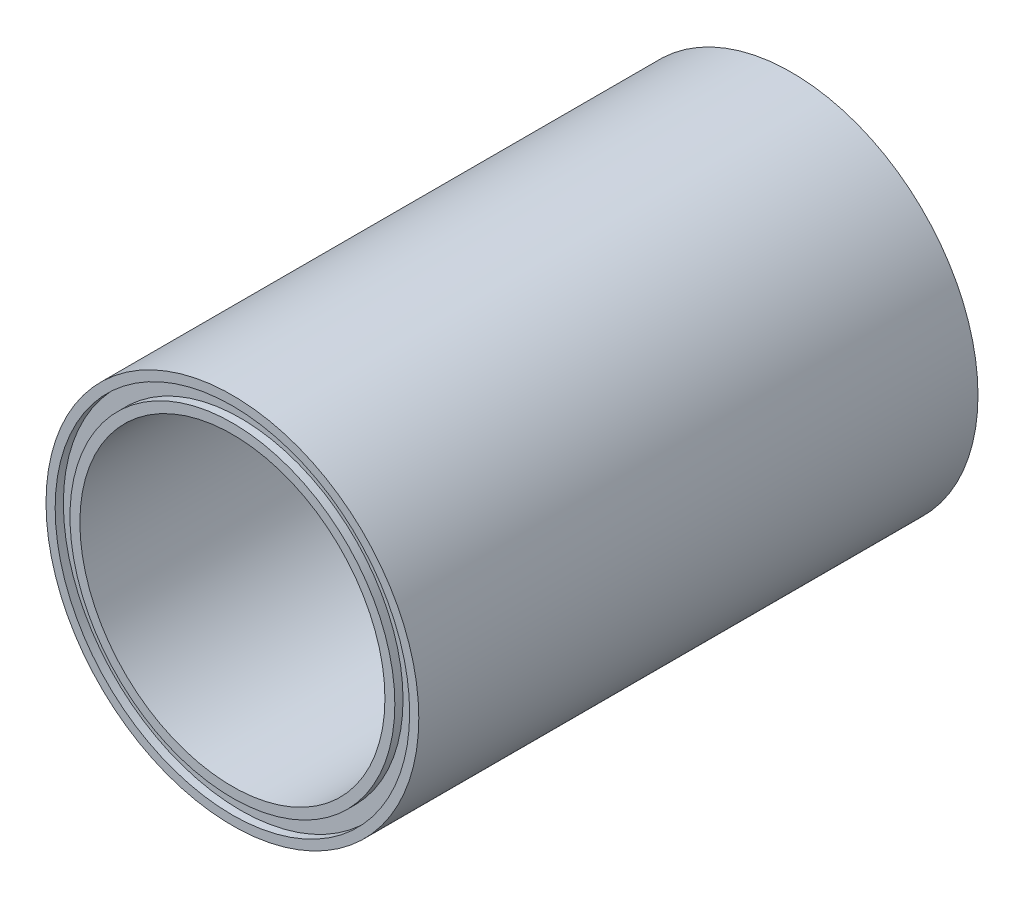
from build123d import *

# Parameters (mm, degrees)
SKETCH1_R           = 44.45
SKETCH1_R_2         = 36.3728
BOSS_EXTRUDE1_DEPTH = 66.675
SKETCH3_R           = 42.2656
SKETCH3_R_2         = 38.735
CUT_EXTRUDE3_DEPTH  = 1.9558


with BuildPart() as part:
    # Sketch1 → Boss-Extrude1 (new, symmetric)
    with BuildSketch(Plane.XY):
        Circle(SKETCH1_R)
        Circle(SKETCH1_R_2, mode=Mode.SUBTRACT)
    extrude(amount=BOSS_EXTRUDE1_DEPTH, both=True)

    # Sketch3 → Cut-Extrude3 (cut)
    with BuildSketch(Plane.XY.offset(66.675)):
        Circle(SKETCH3_R)
        Circle(SKETCH3_R_2, mode=Mode.SUBTRACT)
    cut_extrude3 = extrude(amount=-CUT_EXTRUDE3_DEPTH, mode=Mode.SUBTRACT)

    # Mirror1: Cut-Extrude3 across plane
    add(cut_extrude3.mirror(Plane.XY), mode=Mode.SUBTRACT)


solid = part.part
